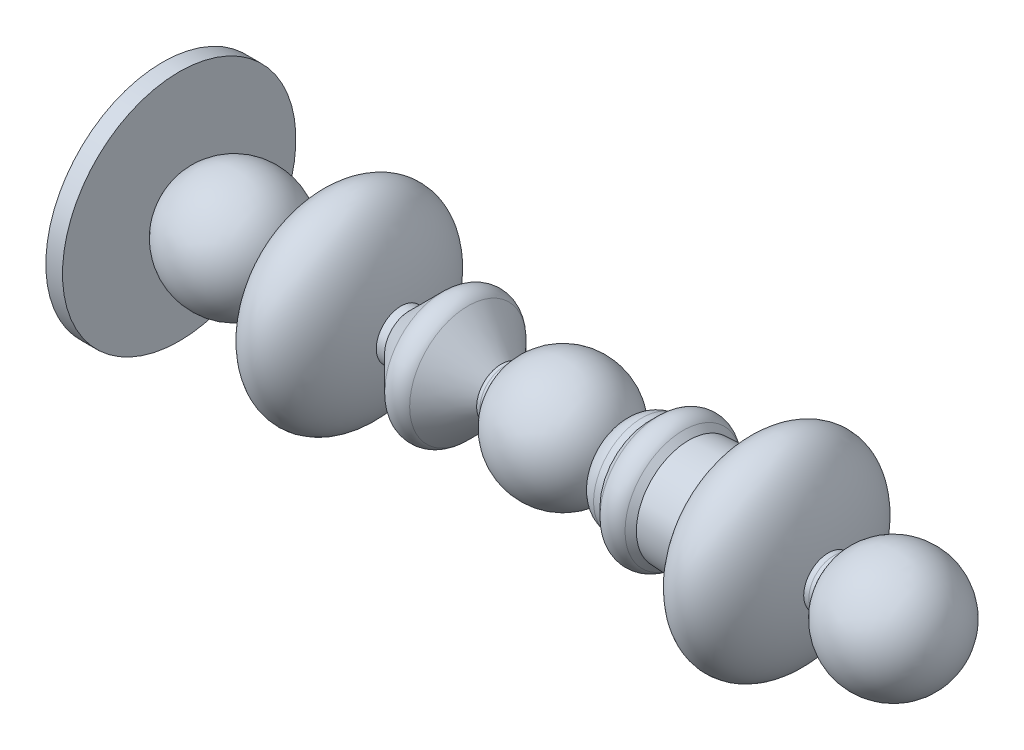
ISO-10303-21;
HEADER;
FILE_DESCRIPTION(('STEP AP214'),'2;1');
FILE_NAME('part.step','',(''),(''),'','','');
FILE_SCHEMA(('AUTOMOTIVE_DESIGN { 1 0 10303 214 1 1 1 1 }'));
ENDSEC;
DATA;
#1=APPLICATION_CONTEXT('core data for automotive mechanical design processes');
#2=APPLICATION_PROTOCOL_DEFINITION('international standard','automotive_design',2000,#1);
#3=PRODUCT_CONTEXT('',#1,'mechanical');
#4=PRODUCT('Part','Part','',(#3));
#5=PRODUCT_RELATED_PRODUCT_CATEGORY('part','',(#4));
#6=PRODUCT_DEFINITION_FORMATION('','',#4);
#7=PRODUCT_DEFINITION_CONTEXT('part definition',#1,'design');
#8=PRODUCT_DEFINITION('design','',#6,#7);
#9=PRODUCT_DEFINITION_SHAPE('','',#8);
#10=(LENGTH_UNIT() NAMED_UNIT(*) SI_UNIT(.MILLI.,.METRE.));
#11=(NAMED_UNIT(*) PLANE_ANGLE_UNIT() SI_UNIT($,.RADIAN.));
#12=(NAMED_UNIT(*) SI_UNIT($,.STERADIAN.) SOLID_ANGLE_UNIT());
#13=UNCERTAINTY_MEASURE_WITH_UNIT(LENGTH_MEASURE(1.E-05),#10,'distance_accuracy_value','');
#14=(GEOMETRIC_REPRESENTATION_CONTEXT(3) GLOBAL_UNCERTAINTY_ASSIGNED_CONTEXT((#13)) GLOBAL_UNIT_ASSIGNED_CONTEXT((#10,
#11,#12)) REPRESENTATION_CONTEXT('',''));
#15=CARTESIAN_POINT('',(0.,0.,0.));
#16=DIRECTION('',(0.,0.,1.));
#17=DIRECTION('',(1.,0.,0.));
#18=AXIS2_PLACEMENT_3D('',#15,#16,#17);
#19=CARTESIAN_POINT('',(-493.124200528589,0.,0.));
#20=DIRECTION('',(1.,0.,0.));
#21=DIRECTION('',(0.,1.,0.));
#22=AXIS2_PLACEMENT_3D('',#19,#20,#21);
#23=SPHERICAL_SURFACE('',#22,90.);
#24=CARTESIAN_POINT('',(-410.624200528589,0.,0.));
#25=DIRECTION('',(-1.,0.,0.));
#26=DIRECTION('',(0.,-1.,0.));
#27=AXIS2_PLACEMENT_3D('',#24,#25,#26);
#28=CIRCLE('',#27,35.9687364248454);
#29=CARTESIAN_POINT('',(-410.624200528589,35.9687364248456,0.));
#30=VERTEX_POINT('',#29);
#31=EDGE_CURVE('E51',#30,#30,#28,.T.);
#32=CARTESIAN_POINT('',(-575.624200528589,0.,0.));
#33=DIRECTION('',(-1.,0.,0.));
#34=DIRECTION('',(0.,-1.,0.));
#35=AXIS2_PLACEMENT_3D('',#32,#33,#34);
#36=CIRCLE('',#35,35.9687364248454);
#37=CARTESIAN_POINT('',(-575.624200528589,35.9687364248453,0.));
#38=VERTEX_POINT('',#37);
#39=EDGE_CURVE('E11',#38,#38,#36,.T.);
#40=CARTESIAN_POINT('',(-410.624200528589,35.9687364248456,0.));
#41=CARTESIAN_POINT('',(-411.058686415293,36.9653219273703,0.));
#42=CARTESIAN_POINT('',(-411.511246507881,37.9540267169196,0.));
#43=CARTESIAN_POINT('',(-412.451884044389,39.9143942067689,0.));
#44=CARTESIAN_POINT('',(-412.939961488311,40.8860569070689,0.));
#45=CARTESIAN_POINT('',(-413.951002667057,42.811059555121,0.));
#46=CARTESIAN_POINT('',(-414.47396640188,43.7643995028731,0.));
#47=CARTESIAN_POINT('',(-415.554090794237,45.6515060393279,0.));
#48=CARTESIAN_POINT('',(-416.11125145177,46.5852726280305,0.));
#49=CARTESIAN_POINT('',(-417.25903876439,48.4320059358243,0.));
#50=CARTESIAN_POINT('',(-417.849665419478,49.3449726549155,0.));
#51=CARTESIAN_POINT('',(-419.063608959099,51.148907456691,0.));
#52=CARTESIAN_POINT('',(-419.686925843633,52.0398755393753,0.));
#53=CARTESIAN_POINT('',(-420.965431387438,53.7986430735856,0.));
#54=CARTESIAN_POINT('',(-421.62062004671,54.6664425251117,0.));
#55=CARTESIAN_POINT('',(-422.9620087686,56.3777332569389,0.));
#56=CARTESIAN_POINT('',(-423.648208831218,57.2212245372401,0.));
#57=CARTESIAN_POINT('',(-425.050719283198,58.8827912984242,0.));
#58=CARTESIAN_POINT('',(-425.767029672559,59.7008667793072,0.));
#59=CARTESIAN_POINT('',(-427.228820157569,61.3105276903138,0.));
#60=CARTESIAN_POINT('',(-427.974300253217,62.1021131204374,0.));
#61=CARTESIAN_POINT('',(-429.493451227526,63.6577544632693,0.));
#62=CARTESIAN_POINT('',(-430.267122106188,64.4218103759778,0.));
#63=CARTESIAN_POINT('',(-431.841638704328,65.9213893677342,0.));
#64=CARTESIAN_POINT('',(-432.642484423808,66.6569124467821,0.));
#65=CARTESIAN_POINT('',(-434.27029907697,68.0984599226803,0.));
#66=CARTESIAN_POINT('',(-435.097268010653,68.8044843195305,0.));
#67=CARTESIAN_POINT('',(-436.776243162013,70.1861073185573,0.));
#68=CARTESIAN_POINT('',(-437.62824937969,70.8617059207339,0.));
#69=CARTESIAN_POINT('',(-439.356180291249,72.1815901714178,0.));
#70=CARTESIAN_POINT('',(-440.23210498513,72.8258758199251,0.));
#71=CARTESIAN_POINT('',(-442.006722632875,74.0822881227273,0.));
#72=CARTESIAN_POINT('',(-442.90541558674,74.6944147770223,0.));
#73=CARTESIAN_POINT('',(-444.724389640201,75.8857052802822,0.));
#74=CARTESIAN_POINT('',(-445.644670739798,76.4648691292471,0.));
#75=CARTESIAN_POINT('',(-447.505612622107,77.5894734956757,0.));
#76=CARTESIAN_POINT('',(-448.446273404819,78.1349140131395,0.));
#77=CARTESIAN_POINT('',(-450.34673942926,79.191355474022,0.));
#78=CARTESIAN_POINT('',(-451.306544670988,79.7023564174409,0.));
#79=CARTESIAN_POINT('',(-453.244039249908,80.6892477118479,0.));
#80=CARTESIAN_POINT('',(-454.221728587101,81.1651380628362,0.));
#81=CARTESIAN_POINT('',(-456.193707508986,82.0811832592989,0.));
#82=CARTESIAN_POINT('',(-457.187997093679,82.5213381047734,0.));
#83=CARTESIAN_POINT('',(-459.191870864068,83.3653343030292,0.));
#84=CARTESIAN_POINT('',(-460.201455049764,83.7691756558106,0.));
#85=CARTESIAN_POINT('',(-462.23459229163,84.5400145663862,0.));
#86=CARTESIAN_POINT('',(-463.258145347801,84.9070121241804,0.));
#87=CARTESIAN_POINT('',(-465.317876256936,85.6036815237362,0.));
#88=CARTESIAN_POINT('',(-466.3540541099,85.9333533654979,0.));
#89=CARTESIAN_POINT('',(-468.437673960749,86.5549384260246,0.));
#90=CARTESIAN_POINT('',(-469.485115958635,86.8468516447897,0.));
#91=CARTESIAN_POINT('',(-471.589888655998,87.3925361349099,0.));
#92=CARTESIAN_POINT('',(-472.647219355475,87.6463074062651,0.));
#93=CARTESIAN_POINT('',(-474.770381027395,88.1153747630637,0.));
#94=CARTESIAN_POINT('',(-475.836211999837,88.3306708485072,0.));
#95=CARTESIAN_POINT('',(-477.974974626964,88.7225051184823,0.));
#96=CARTESIAN_POINT('',(-479.047906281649,88.899043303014,0.));
#97=CARTESIAN_POINT('',(-481.199461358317,89.2131299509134,0.));
#98=CARTESIAN_POINT('',(-482.278084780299,89.3506784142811,0.));
#99=CARTESIAN_POINT('',(-484.439607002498,89.5866049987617,0.));
#100=CARTESIAN_POINT('',(-485.522505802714,89.6849831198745,0.));
#101=CARTESIAN_POINT('',(-487.691156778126,89.8424398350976,0.));
#102=CARTESIAN_POINT('',(-488.776908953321,89.9015184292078,0.));
#103=CARTESIAN_POINT('',(-490.949840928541,89.980298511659,0.));
#104=CARTESIAN_POINT('',(-492.037020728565,90.,0.));
#105=CARTESIAN_POINT('',(-494.211380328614,90.,0.));
#106=CARTESIAN_POINT('',(-495.298560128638,89.980298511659,0.));
#107=CARTESIAN_POINT('',(-497.471492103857,89.9015184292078,0.));
#108=CARTESIAN_POINT('',(-498.557244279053,89.8424398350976,0.));
#109=CARTESIAN_POINT('',(-500.725895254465,89.6849831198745,0.));
#110=CARTESIAN_POINT('',(-501.808794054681,89.5866049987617,0.));
#111=CARTESIAN_POINT('',(-503.970316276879,89.3506784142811,0.));
#112=CARTESIAN_POINT('',(-505.048939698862,89.2131299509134,0.));
#113=CARTESIAN_POINT('',(-507.200494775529,88.8990433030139,0.));
#114=CARTESIAN_POINT('',(-508.273426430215,88.7225051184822,0.));
#115=CARTESIAN_POINT('',(-510.412189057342,88.3306708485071,0.));
#116=CARTESIAN_POINT('',(-511.478020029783,88.1153747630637,0.));
#117=CARTESIAN_POINT('',(-513.601181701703,87.6463074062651,0.));
#118=CARTESIAN_POINT('',(-514.658512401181,87.3925361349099,0.));
#119=CARTESIAN_POINT('',(-516.763285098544,86.8468516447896,0.));
#120=CARTESIAN_POINT('',(-517.810727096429,86.5549384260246,0.));
#121=CARTESIAN_POINT('',(-519.894346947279,85.9333533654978,0.));
#122=CARTESIAN_POINT('',(-520.930524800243,85.6036815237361,0.));
#123=CARTESIAN_POINT('',(-522.990255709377,84.9070121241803,0.));
#124=CARTESIAN_POINT('',(-524.013808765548,84.5400145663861,0.));
#125=CARTESIAN_POINT('',(-526.046946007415,83.7691756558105,0.));
#126=CARTESIAN_POINT('',(-527.056530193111,83.3653343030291,0.));
#127=CARTESIAN_POINT('',(-529.0604039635,82.5213381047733,0.));
#128=CARTESIAN_POINT('',(-530.054693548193,82.0811832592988,0.));
#129=CARTESIAN_POINT('',(-532.026672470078,81.1651380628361,0.));
#130=CARTESIAN_POINT('',(-533.004361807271,80.6892477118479,0.));
#131=CARTESIAN_POINT('',(-534.941856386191,79.7023564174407,0.));
#132=CARTESIAN_POINT('',(-535.901661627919,79.1913554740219,0.));
#133=CARTESIAN_POINT('',(-537.802127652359,78.1349140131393,0.));
#134=CARTESIAN_POINT('',(-538.742788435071,77.5894734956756,0.));
#135=CARTESIAN_POINT('',(-540.60373031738,76.464869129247,0.));
#136=CARTESIAN_POINT('',(-541.524011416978,75.885705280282,0.));
#137=CARTESIAN_POINT('',(-543.342985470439,74.6944147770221,0.));
#138=CARTESIAN_POINT('',(-544.241678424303,74.0822881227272,0.));
#139=CARTESIAN_POINT('',(-546.016296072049,72.825875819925,0.));
#140=CARTESIAN_POINT('',(-546.89222076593,72.1815901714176,0.));
#141=CARTESIAN_POINT('',(-548.620151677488,70.8617059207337,0.));
#142=CARTESIAN_POINT('',(-549.472157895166,70.1861073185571,0.));
#143=CARTESIAN_POINT('',(-551.151133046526,68.8044843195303,0.));
#144=CARTESIAN_POINT('',(-551.978101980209,68.0984599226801,0.));
#145=CARTESIAN_POINT('',(-553.605916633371,66.656912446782,0.));
#146=CARTESIAN_POINT('',(-554.40676235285,65.921389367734,0.));
#147=CARTESIAN_POINT('',(-555.981278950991,64.4218103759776,0.));
#148=CARTESIAN_POINT('',(-556.754949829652,63.6577544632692,0.));
#149=CARTESIAN_POINT('',(-558.274100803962,62.1021131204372,0.));
#150=CARTESIAN_POINT('',(-559.01958089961,61.3105276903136,0.));
#151=CARTESIAN_POINT('',(-560.481371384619,59.700866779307,0.));
#152=CARTESIAN_POINT('',(-561.197681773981,58.882791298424,0.));
#153=CARTESIAN_POINT('',(-562.600192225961,57.2212245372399,0.));
#154=CARTESIAN_POINT('',(-563.286392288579,56.3777332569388,0.));
#155=CARTESIAN_POINT('',(-564.627781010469,54.6664425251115,0.));
#156=CARTESIAN_POINT('',(-565.282969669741,53.7986430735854,0.));
#157=CARTESIAN_POINT('',(-566.561475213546,52.039875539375,0.));
#158=CARTESIAN_POINT('',(-567.18479209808,51.1489074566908,0.));
#159=CARTESIAN_POINT('',(-568.398735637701,49.3449726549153,0.));
#160=CARTESIAN_POINT('',(-568.989362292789,48.4320059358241,0.));
#161=CARTESIAN_POINT('',(-570.137149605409,46.5852726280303,0.));
#162=CARTESIAN_POINT('',(-570.694310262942,45.6515060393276,0.));
#163=CARTESIAN_POINT('',(-571.774434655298,43.7643995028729,0.));
#164=CARTESIAN_POINT('',(-572.297398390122,42.8110595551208,0.));
#165=CARTESIAN_POINT('',(-573.308439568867,40.8860569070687,0.));
#166=CARTESIAN_POINT('',(-573.796517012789,39.9143942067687,0.));
#167=CARTESIAN_POINT('',(-574.737154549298,37.9540267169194,0.));
#168=CARTESIAN_POINT('',(-575.189714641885,36.96532192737,0.));
#169=CARTESIAN_POINT('',(-575.624200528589,35.9687364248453,0.));
#170=B_SPLINE_CURVE_WITH_KNOTS('',3,(#40,#41,#42,#43,#44,#45,#46,#47,#48,#49,#50,#51,#52,#53,
#54,#55,#56,#57,#58,#59,#60,#61,#62,#63,#64,#65,#66,#67,#68,#69,#70,#71,#72,#73,#74,#75,#76,#77,
#78,#79,#80,#81,#82,#83,#84,#85,#86,#87,#88,#89,#90,#91,#92,#93,#94,#95,#96,#97,#98,#99,#100,
#101,#102,#103,#104,#105,#106,#107,#108,#109,#110,#111,#112,#113,#114,#115,#116,#117,#118,#119,
#120,#121,#122,#123,#124,#125,#126,#127,#128,#129,#130,#131,#132,#133,#134,#135,#136,#137,#138,
#139,#140,#141,#142,#143,#144,#145,#146,#147,#148,#149,#150,#151,#152,#153,#154,#155,#156,#157,
#158,#159,#160,#161,#162,#163,#164,#165,#166,#167,#168,#169),.UNSPECIFIED.,.F.,.F.,(4,2,2,2,2,2,
2,2,2,2,2,2,2,2,2,2,2,2,2,2,2,2,2,2,2,2,2,2,2,2,2,2,2,2,2,2,2,2,2,2,2,2,2,2,2,2,2,2,2,2,2,2,2,2,
2,2,2,2,2,2,2,2,2,2,4),(0.,3.26136096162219,6.52272192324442,9.7840828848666,13.0454438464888,
16.306804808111,19.5681657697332,22.8295267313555,26.0908876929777,29.3522486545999,
32.6136096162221,35.8749705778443,39.1363315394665,42.3976925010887,45.659053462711,
48.9204144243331,52.1817753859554,55.4431363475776,58.7044973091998,61.965858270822,
65.2272192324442,68.4885801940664,71.7499411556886,75.0113021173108,78.272663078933,
81.5340240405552,84.7953850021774,88.0567459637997,91.3181069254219,94.5794678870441,
97.8408288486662,101.102189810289,104.363550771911,107.624911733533,110.886272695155,
114.147633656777,117.4089946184,120.670355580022,123.931716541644,127.193077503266,
130.454438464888,133.715799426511,136.977160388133,140.238521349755,143.499882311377,
146.761243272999,150.022604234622,153.283965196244,156.545326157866,159.806687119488,
163.06804808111,166.329409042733,169.590770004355,172.852130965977,176.113491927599,
179.374852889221,182.636213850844,185.897574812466,189.158935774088,192.42029673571,
195.681657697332,198.943018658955,202.204379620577,205.465740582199,208.727101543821),.UNSPECIFIED.);
#171=EDGE_CURVE('BSEAM45',#30,#38,#170,.T.);
#172=ORIENTED_EDGE('',*,*,#31,.T.);
#173=ORIENTED_EDGE('',*,*,#39,.F.);
#174=ORIENTED_EDGE('',*,*,#171,.T.);
#175=ORIENTED_EDGE('',*,*,#171,.F.);
#176=EDGE_LOOP('',(#172,#174,#173,#175));
#177=FACE_BOUND('',#176,.T.);
#178=ADVANCED_FACE('F45',(#177),#23,.T.);
#179=CARTESIAN_POINT('',(-410.624200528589,35.9687364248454,0.));
#180=DIRECTION('',(-1.,0.,0.));
#181=DIRECTION('',(0.,1.,0.));
#182=AXIS2_PLACEMENT_3D('',#179,#180,#181);
#183=PLANE('',#182);
#184=ORIENTED_EDGE('',*,*,#31,.F.);
#185=EDGE_LOOP('',(#184));
#186=FACE_BOUND('',#185,.T.);
#187=ADVANCED_FACE('F78',(#186),#183,.F.);
#188=CARTESIAN_POINT('',(-600.624200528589,0.,0.));
#189=DIRECTION('',(1.,0.,0.));
#190=DIRECTION('',(0.,1.,0.));
#191=AXIS2_PLACEMENT_3D('',#188,#189,#190);
#192=CYLINDRICAL_SURFACE('',#191,175.);
#193=CARTESIAN_POINT('',(-600.624200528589,0.,0.));
#194=DIRECTION('',(-1.,0.,0.));
#195=DIRECTION('',(0.,-1.,0.));
#196=AXIS2_PLACEMENT_3D('',#193,#194,#195);
#197=CIRCLE('',#196,175.);
#198=CARTESIAN_POINT('',(-600.624200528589,-175.,0.));
#199=VERTEX_POINT('',#198);
#200=EDGE_CURVE('E55',#199,#199,#197,.T.);
#201=ORIENTED_EDGE('',*,*,#200,.F.);
#202=EDGE_LOOP('',(#201));
#203=FACE_BOUND('',#202,.T.);
#204=CARTESIAN_POINT('',(-575.624200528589,0.,0.));
#205=DIRECTION('',(-1.,0.,0.));
#206=DIRECTION('',(0.,-1.,0.));
#207=AXIS2_PLACEMENT_3D('',#204,#205,#206);
#208=CIRCLE('',#207,175.);
#209=CARTESIAN_POINT('',(-575.624200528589,-175.,0.));
#210=VERTEX_POINT('',#209);
#211=EDGE_CURVE('E59',#210,#210,#208,.T.);
#212=ORIENTED_EDGE('',*,*,#211,.T.);
#213=EDGE_LOOP('',(#212));
#214=FACE_BOUND('',#213,.T.);
#215=ADVANCED_FACE('F65',(#203,#214),#192,.T.);
#216=CARTESIAN_POINT('',(-600.624200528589,0.,0.));
#217=DIRECTION('',(-1.,0.,0.));
#218=DIRECTION('',(0.,-1.,0.));
#219=AXIS2_PLACEMENT_3D('',#216,#217,#218);
#220=PLANE('',#219);
#221=ORIENTED_EDGE('',*,*,#200,.T.);
#222=EDGE_LOOP('',(#221));
#223=FACE_BOUND('',#222,.T.);
#224=ADVANCED_FACE('F69',(#223),#220,.T.);
#225=CARTESIAN_POINT('',(-575.624200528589,0.,0.));
#226=DIRECTION('',(-1.,0.,0.));
#227=DIRECTION('',(0.,-1.,0.));
#228=AXIS2_PLACEMENT_3D('',#225,#226,#227);
#229=PLANE('',#228);
#230=ORIENTED_EDGE('',*,*,#39,.T.);
#231=EDGE_LOOP('',(#230));
#232=FACE_BOUND('',#231,.T.);
#233=ORIENTED_EDGE('',*,*,#211,.F.);
#234=EDGE_LOOP('',(#233));
#235=FACE_BOUND('',#234,.T.);
#236=ADVANCED_FACE('F67',(#232,#235),#229,.F.);
#237=CLOSED_SHELL('',(#178,#187,#215,#224,#236));
#238=MANIFOLD_SOLID_BREP('B2',#237);
#239=CARTESIAN_POINT('',(0.,0.,0.));
#240=DIRECTION('',(1.,0.,0.));
#241=DIRECTION('',(0.,0.,1.));
#242=AXIS2_PLACEMENT_3D('',#239,#240,#241);
#243=CYLINDRICAL_SURFACE('',#242,37.);
#244=CARTESIAN_POINT('',(-398.028030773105,0.,0.));
#245=DIRECTION('',(1.,0.,0.));
#246=DIRECTION('',(0.,0.,-1.));
#247=AXIS2_PLACEMENT_3D('',#244,#245,#246);
#248=CIRCLE('',#247,37.);
#249=CARTESIAN_POINT('',(-398.028030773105,0.,-37.));
#250=VERTEX_POINT('',#249);
#251=EDGE_CURVE('E147',#250,#250,#248,.T.);
#252=ORIENTED_EDGE('',*,*,#251,.F.);
#253=EDGE_LOOP('',(#252));
#254=FACE_BOUND('',#253,.T.);
#255=CARTESIAN_POINT('',(-404.326115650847,0.,0.));
#256=DIRECTION('',(-1.,0.,0.));
#257=DIRECTION('',(0.,0.,1.));
#258=AXIS2_PLACEMENT_3D('',#255,#256,#257);
#259=CIRCLE('',#258,37.);
#260=CARTESIAN_POINT('',(-404.326115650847,0.,37.));
#261=VERTEX_POINT('',#260);
#262=CARTESIAN_POINT('',(-404.326115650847,0.,-37.));
#263=VERTEX_POINT('',#262);
#264=EDGE_CURVE('E43',#261,#263,#259,.T.);
#265=ORIENTED_EDGE('',*,*,#264,.F.);
#266=EDGE_CURVE('E129',#263,#261,#259,.T.);
#267=ORIENTED_EDGE('',*,*,#266,.F.);
#268=EDGE_LOOP('',(#265,#267));
#269=FACE_BOUND('',#268,.T.);
#270=ADVANCED_FACE('F125',(#254,#269),#243,.T.);
#271=ORIENTED_EDGE('',*,*,#266,.T.);
#272=ORIENTED_EDGE('',*,*,#264,.T.);
#273=EDGE_LOOP('',(#271,#272));
#274=FACE_BOUND('',#273,.T.);
#275=CARTESIAN_POINT('',(-410.624200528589,0.,0.));
#276=DIRECTION('',(-1.,0.,0.));
#277=DIRECTION('',(0.,0.,1.));
#278=AXIS2_PLACEMENT_3D('',#275,#276,#277);
#279=CIRCLE('',#278,37.);
#280=CARTESIAN_POINT('',(-410.624200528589,0.,37.));
#281=VERTEX_POINT('',#280);
#282=EDGE_CURVE('E143',#281,#281,#279,.T.);
#283=ORIENTED_EDGE('',*,*,#282,.F.);
#284=EDGE_LOOP('',(#283));
#285=FACE_BOUND('',#284,.T.);
#286=ADVANCED_FACE('F127',(#274,#285),#243,.T.);
#287=CARTESIAN_POINT('',(-410.624200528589,0.,0.));
#288=DIRECTION('',(1.,0.,0.));
#289=DIRECTION('',(0.,0.,1.));
#290=AXIS2_PLACEMENT_3D('',#287,#288,#289);
#291=PLANE('',#290);
#292=ORIENTED_EDGE('',*,*,#282,.T.);
#293=EDGE_LOOP('',(#292));
#294=FACE_BOUND('',#293,.T.);
#295=ADVANCED_FACE('F164',(#294),#291,.F.);
#296=CARTESIAN_POINT('',(-320.5,0.,0.));
#297=DIRECTION('',(0.,0.,-1.));
#298=DIRECTION('',(0.,1.,0.));
#299=AXIS2_PLACEMENT_3D('',#296,#297,#298);
#300=ELLIPSE('',#299,150.,80.);
#301=TRIMMED_CURVE('',#300,(PARAMETER_VALUE(4.71238898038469)),
(PARAMETER_VALUE(7.85398163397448)),.T.,.PARAMETER.);
#302=CARTESIAN_POINT('',(0.,0.,0.));
#303=DIRECTION('',(1.,0.,0.));
#304=AXIS1_PLACEMENT('',#302,#303);
#305=SURFACE_OF_REVOLUTION('',#301,#304);
#306=CARTESIAN_POINT('',(-242.971969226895,0.,0.));
#307=DIRECTION('',(1.,0.,0.));
#308=DIRECTION('',(0.,0.,-1.));
#309=AXIS2_PLACEMENT_3D('',#306,#307,#308);
#310=CIRCLE('',#309,37.);
#311=CARTESIAN_POINT('',(-242.971969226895,0.,-37.));
#312=VERTEX_POINT('',#311);
#313=EDGE_CURVE('E151',#312,#312,#310,.T.);
#314=ORIENTED_EDGE('',*,*,#313,.F.);
#315=EDGE_LOOP('',(#314));
#316=FACE_BOUND('',#315,.T.);
#317=ORIENTED_EDGE('',*,*,#251,.T.);
#318=EDGE_LOOP('',(#317));
#319=FACE_BOUND('',#318,.T.);
#320=ADVANCED_FACE('F160',(#316,#319),#305,.T.);
#321=CARTESIAN_POINT('',(-400.502,0.,0.));
#322=DIRECTION('',(1.,0.,0.));
#323=DIRECTION('',(0.,0.,-1.));
#324=AXIS2_PLACEMENT_3D('',#321,#322,#323);
#325=CYLINDRICAL_SURFACE('',#324,37.);
#326=ORIENTED_EDGE('',*,*,#313,.T.);
#327=EDGE_LOOP('',(#326));
#328=FACE_BOUND('',#327,.T.);
#329=CARTESIAN_POINT('',(-230.5,0.,0.));
#330=DIRECTION('',(-1.,0.,0.));
#331=DIRECTION('',(0.,0.,1.));
#332=AXIS2_PLACEMENT_3D('',#329,#330,#331);
#333=CIRCLE('',#332,37.);
#334=CARTESIAN_POINT('',(-230.5,0.,37.));
#335=VERTEX_POINT('',#334);
#336=EDGE_CURVE('E156',#335,#335,#333,.T.);
#337=ORIENTED_EDGE('',*,*,#336,.T.);
#338=EDGE_LOOP('',(#337));
#339=FACE_BOUND('',#338,.T.);
#340=ADVANCED_FACE('F163',(#328,#339),#325,.T.);
#341=CARTESIAN_POINT('',(-230.5,37.,0.));
#342=DIRECTION('',(-1.,0.,0.));
#343=DIRECTION('',(0.,0.,-1.));
#344=AXIS2_PLACEMENT_3D('',#341,#342,#343);
#345=PLANE('',#344);
#346=ORIENTED_EDGE('',*,*,#336,.F.);
#347=EDGE_LOOP('',(#346));
#348=FACE_BOUND('',#347,.T.);
#349=ADVANCED_FACE('F195',(#348),#345,.F.);
#350=CLOSED_SHELL('',(#270,#286,#295,#320,#340,#349));
#351=MANIFOLD_SOLID_BREP('B6',#350);
#352=CARTESIAN_POINT('',(0.,0.,0.));
#353=DIRECTION('',(1.,0.,0.));
#354=DIRECTION('',(0.,0.,1.));
#355=AXIS2_PLACEMENT_3D('',#352,#353,#354);
#356=CYLINDRICAL_SURFACE('',#355,37.);
#357=CARTESIAN_POINT('',(-82.5,0.,0.));
#358=DIRECTION('',(-1.,0.,0.));
#359=DIRECTION('',(0.,0.,1.));
#360=AXIS2_PLACEMENT_3D('',#357,#358,#359);
#361=CIRCLE('',#360,37.);
#362=CARTESIAN_POINT('',(-82.5,0.,37.));
#363=VERTEX_POINT('',#362);
#364=EDGE_CURVE('E258',#363,#363,#361,.T.);
#365=ORIENTED_EDGE('',*,*,#364,.T.);
#366=EDGE_LOOP('',(#365));
#367=FACE_BOUND('',#366,.T.);
#368=CARTESIAN_POINT('',(-87.5,0.,0.));
#369=DIRECTION('',(-1.,0.,0.));
#370=DIRECTION('',(0.,0.,1.));
#371=AXIS2_PLACEMENT_3D('',#368,#369,#370);
#372=CIRCLE('',#371,37.);
#373=CARTESIAN_POINT('',(-87.5,0.,37.));
#374=VERTEX_POINT('',#373);
#375=CARTESIAN_POINT('',(-87.5,0.,-37.));
#376=VERTEX_POINT('',#375);
#377=EDGE_CURVE('E123',#374,#376,#372,.T.);
#378=ORIENTED_EDGE('',*,*,#377,.F.);
#379=EDGE_CURVE('E243',#376,#374,#372,.T.);
#380=ORIENTED_EDGE('',*,*,#379,.F.);
#381=EDGE_LOOP('',(#378,#380));
#382=FACE_BOUND('',#381,.T.);
#383=ADVANCED_FACE('F239',(#367,#382),#356,.T.);
#384=CARTESIAN_POINT('',(-82.5,0.,0.));
#385=DIRECTION('',(-1.,0.,0.));
#386=DIRECTION('',(0.,0.,-1.));
#387=AXIS2_PLACEMENT_3D('',#384,#385,#386);
#388=PLANE('',#387);
#389=ORIENTED_EDGE('',*,*,#364,.F.);
#390=EDGE_LOOP('',(#389));
#391=FACE_BOUND('',#390,.T.);
#392=ADVANCED_FACE('F241',(#391),#388,.F.);
#393=ORIENTED_EDGE('',*,*,#379,.T.);
#394=ORIENTED_EDGE('',*,*,#377,.T.);
#395=EDGE_LOOP('',(#393,#394));
#396=FACE_BOUND('',#395,.T.);
#397=CARTESIAN_POINT('',(-92.5,0.,0.));
#398=DIRECTION('',(-1.,0.,0.));
#399=DIRECTION('',(0.,0.,1.));
#400=AXIS2_PLACEMENT_3D('',#397,#398,#399);
#401=CIRCLE('',#400,37.);
#402=CARTESIAN_POINT('',(-92.5,0.,37.));
#403=VERTEX_POINT('',#402);
#404=EDGE_CURVE('E262',#403,#403,#401,.T.);
#405=ORIENTED_EDGE('',*,*,#404,.F.);
#406=EDGE_LOOP('',(#405));
#407=FACE_BOUND('',#406,.T.);
#408=ADVANCED_FACE('F255',(#396,#407),#356,.T.);
#409=CARTESIAN_POINT('',(-92.5,0.,0.));
#410=DIRECTION('',(1.,0.,0.));
#411=DIRECTION('',(0.,0.,1.));
#412=AXIS2_PLACEMENT_3D('',#409,#410,#411);
#413=PLANE('',#412);
#414=ORIENTED_EDGE('',*,*,#404,.T.);
#415=EDGE_LOOP('',(#414));
#416=FACE_BOUND('',#415,.T.);
#417=ADVANCED_FACE('F269',(#416),#413,.F.);
#418=CLOSED_SHELL('',(#383,#392,#408,#417));
#419=MANIFOLD_SOLID_BREP('B37',#418);
#420=CARTESIAN_POINT('',(-161.5,0.,0.));
#421=DIRECTION('',(1.,0.,0.));
#422=DIRECTION('',(0.,0.,1.));
#423=AXIS2_PLACEMENT_3D('',#420,#421,#422);
#424=TOROIDAL_SURFACE('',#423,68.4436508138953,26.5563491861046);
#425=CARTESIAN_POINT('',(-142.721825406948,0.,0.));
#426=DIRECTION('',(-1.,0.,0.));
#427=DIRECTION('',(0.,0.,1.));
#428=AXIS2_PLACEMENT_3D('',#425,#426,#427);
#429=CIRCLE('',#428,87.2218254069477);
#430=CARTESIAN_POINT('',(-142.721825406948,0.,87.2218254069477));
#431=VERTEX_POINT('',#430);
#432=EDGE_CURVE('E238',#431,#431,#429,.T.);
#433=ORIENTED_EDGE('',*,*,#432,.T.);
#434=EDGE_LOOP('',(#433));
#435=FACE_BOUND('',#434,.T.);
#436=CARTESIAN_POINT('',(-180.278174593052,0.,0.));
#437=DIRECTION('',(-1.,0.,0.));
#438=DIRECTION('',(0.,0.,1.));
#439=AXIS2_PLACEMENT_3D('',#436,#437,#438);
#440=CIRCLE('',#439,87.2218254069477);
#441=CARTESIAN_POINT('',(-180.278174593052,0.,87.2218254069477));
#442=VERTEX_POINT('',#441);
#443=EDGE_CURVE('E334',#442,#442,#440,.T.);
#444=ORIENTED_EDGE('',*,*,#443,.F.);
#445=EDGE_LOOP('',(#444));
#446=FACE_BOUND('',#445,.T.);
#447=ADVANCED_FACE('F320',(#435,#446),#424,.T.);
#448=CARTESIAN_POINT('',(-142.721825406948,0.,0.));
#449=DIRECTION('',(-1.,0.,0.));
#450=DIRECTION('',(0.,0.,-1.));
#451=AXIS2_PLACEMENT_3D('',#448,#449,#450);
#452=CONICAL_SURFACE('',#451,87.2218254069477,0.78539816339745);
#453=CARTESIAN_POINT('',(-92.5,0.,0.));
#454=DIRECTION('',(-1.,0.,0.));
#455=DIRECTION('',(0.,0.,1.));
#456=AXIS2_PLACEMENT_3D('',#453,#454,#455);
#457=CIRCLE('',#456,37.);
#458=CARTESIAN_POINT('',(-92.5,0.,37.));
#459=VERTEX_POINT('',#458);
#460=EDGE_CURVE('E326',#459,#459,#457,.T.);
#461=ORIENTED_EDGE('',*,*,#460,.T.);
#462=EDGE_LOOP('',(#461));
#463=FACE_BOUND('',#462,.T.);
#464=ORIENTED_EDGE('',*,*,#432,.F.);
#465=EDGE_LOOP('',(#464));
#466=FACE_BOUND('',#465,.T.);
#467=ADVANCED_FACE('F344',(#463,#466),#452,.T.);
#468=CARTESIAN_POINT('',(-92.5,0.,0.));
#469=DIRECTION('',(-1.,0.,0.));
#470=DIRECTION('',(0.,0.,-1.));
#471=AXIS2_PLACEMENT_3D('',#468,#469,#470);
#472=PLANE('',#471);
#473=ORIENTED_EDGE('',*,*,#460,.F.);
#474=EDGE_LOOP('',(#473));
#475=FACE_BOUND('',#474,.T.);
#476=ADVANCED_FACE('F348',(#475),#472,.F.);
#477=CARTESIAN_POINT('',(-230.5,0.,0.));
#478=DIRECTION('',(1.,0.,0.));
#479=DIRECTION('',(0.,0.,1.));
#480=AXIS2_PLACEMENT_3D('',#477,#478,#479);
#481=PLANE('',#480);
#482=CARTESIAN_POINT('',(-230.5,0.,0.));
#483=DIRECTION('',(-1.,0.,0.));
#484=DIRECTION('',(0.,0.,1.));
#485=AXIS2_PLACEMENT_3D('',#482,#483,#484);
#486=CIRCLE('',#485,37.);
#487=CARTESIAN_POINT('',(-230.5,0.,37.));
#488=VERTEX_POINT('',#487);
#489=EDGE_CURVE('E330',#488,#488,#486,.T.);
#490=ORIENTED_EDGE('',*,*,#489,.T.);
#491=EDGE_LOOP('',(#490));
#492=FACE_BOUND('',#491,.T.);
#493=ADVANCED_FACE('F352',(#492),#481,.F.);
#494=CARTESIAN_POINT('',(-230.5,0.,0.));
#495=DIRECTION('',(1.,0.,0.));
#496=DIRECTION('',(0.,0.,1.));
#497=AXIS2_PLACEMENT_3D('',#494,#495,#496);
#498=CONICAL_SURFACE('',#497,37.,0.78539816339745);
#499=ORIENTED_EDGE('',*,*,#443,.T.);
#500=EDGE_LOOP('',(#499));
#501=FACE_BOUND('',#500,.T.);
#502=ORIENTED_EDGE('',*,*,#489,.F.);
#503=EDGE_LOOP('',(#502));
#504=FACE_BOUND('',#503,.T.);
#505=ADVANCED_FACE('F340',(#501,#504),#498,.T.);
#506=CLOSED_SHELL('',(#447,#467,#476,#493,#505));
#507=MANIFOLD_SOLID_BREP('B117',#506);
#508=CARTESIAN_POINT('',(585.479014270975,0.,0.));
#509=DIRECTION('',(-1.,0.,0.));
#510=DIRECTION('',(0.,0.,1.));
#511=AXIS2_PLACEMENT_3D('',#508,#509,#510);
#512=CYLINDRICAL_SURFACE('',#511,37.);
#513=CARTESIAN_POINT('',(413.4343424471,0.,0.));
#514=DIRECTION('',(1.,0.,0.));
#515=DIRECTION('',(0.,0.,-1.));
#516=AXIS2_PLACEMENT_3D('',#513,#514,#515);
#517=CIRCLE('',#516,37.);
#518=CARTESIAN_POINT('',(413.4343424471,0.,-37.));
#519=VERTEX_POINT('',#518);
#520=EDGE_CURVE('E419',#519,#519,#517,.F.);
#521=ORIENTED_EDGE('',*,*,#520,.T.);
#522=EDGE_LOOP('',(#521));
#523=FACE_BOUND('',#522,.T.);
#524=CARTESIAN_POINT('',(405.731186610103,0.,0.));
#525=DIRECTION('',(-1.,0.,0.));
#526=DIRECTION('',(0.,0.,1.));
#527=AXIS2_PLACEMENT_3D('',#524,#525,#526);
#528=CIRCLE('',#527,37.);
#529=CARTESIAN_POINT('',(405.731186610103,0.,37.));
#530=VERTEX_POINT('',#529);
#531=CARTESIAN_POINT('',(405.731186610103,0.,-37.));
#532=VERTEX_POINT('',#531);
#533=EDGE_CURVE('E318',#530,#532,#528,.T.);
#534=ORIENTED_EDGE('',*,*,#533,.F.);
#535=EDGE_CURVE('E404',#532,#530,#528,.T.);
#536=ORIENTED_EDGE('',*,*,#535,.F.);
#537=EDGE_LOOP('',(#534,#536));
#538=FACE_BOUND('',#537,.T.);
#539=ADVANCED_FACE('F400',(#523,#538),#512,.T.);
#540=CARTESIAN_POINT('',(495.477014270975,0.,0.));
#541=DIRECTION('',(-1.,0.,0.));
#542=DIRECTION('',(0.,1.,0.));
#543=AXIS2_PLACEMENT_3D('',#540,#541,#542);
#544=SPHERICAL_SURFACE('',#543,90.);
#545=ORIENTED_EDGE('',*,*,#520,.F.);
#546=EDGE_LOOP('',(#545));
#547=FACE_BOUND('',#546,.T.);
#548=ADVANCED_FACE('F402',(#547),#544,.T.);
#549=ORIENTED_EDGE('',*,*,#535,.T.);
#550=ORIENTED_EDGE('',*,*,#533,.T.);
#551=EDGE_LOOP('',(#549,#550));
#552=FACE_BOUND('',#551,.T.);
#553=CARTESIAN_POINT('',(398.028030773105,0.,0.));
#554=DIRECTION('',(-1.,0.,0.));
#555=DIRECTION('',(0.,0.,1.));
#556=AXIS2_PLACEMENT_3D('',#553,#554,#555);
#557=CIRCLE('',#556,37.);
#558=CARTESIAN_POINT('',(398.028030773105,0.,37.));
#559=VERTEX_POINT('',#558);
#560=EDGE_CURVE('E423',#559,#559,#557,.T.);
#561=ORIENTED_EDGE('',*,*,#560,.F.);
#562=EDGE_LOOP('',(#561));
#563=FACE_BOUND('',#562,.T.);
#564=ADVANCED_FACE('F416',(#552,#563),#512,.T.);
#565=CARTESIAN_POINT('',(320.5,0.,0.));
#566=DIRECTION('',(0.,0.,1.));
#567=DIRECTION('',(0.,1.,0.));
#568=AXIS2_PLACEMENT_3D('',#565,#566,#567);
#569=ELLIPSE('',#568,150.,80.);
#570=TRIMMED_CURVE('',#569,(PARAMETER_VALUE(4.71238898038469)),
(PARAMETER_VALUE(7.85398163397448)),.T.,.PARAMETER.);
#571=CARTESIAN_POINT('',(0.,0.,0.));
#572=DIRECTION('',(-1.,0.,0.));
#573=AXIS1_PLACEMENT('',#571,#572);
#574=SURFACE_OF_REVOLUTION('',#570,#573);
#575=CARTESIAN_POINT('',(242.971969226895,0.,0.));
#576=DIRECTION('',(-1.,0.,0.));
#577=DIRECTION('',(0.,0.,1.));
#578=AXIS2_PLACEMENT_3D('',#575,#576,#577);
#579=CIRCLE('',#578,37.);
#580=CARTESIAN_POINT('',(242.971969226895,0.,37.));
#581=VERTEX_POINT('',#580);
#582=EDGE_CURVE('E427',#581,#581,#579,.T.);
#583=ORIENTED_EDGE('',*,*,#582,.F.);
#584=EDGE_LOOP('',(#583));
#585=FACE_BOUND('',#584,.T.);
#586=ORIENTED_EDGE('',*,*,#560,.T.);
#587=EDGE_LOOP('',(#586));
#588=FACE_BOUND('',#587,.T.);
#589=ADVANCED_FACE('F436',(#585,#588),#574,.T.);
#590=CARTESIAN_POINT('',(400.502,0.,0.));
#591=DIRECTION('',(-1.,0.,0.));
#592=DIRECTION('',(0.,0.,1.));
#593=AXIS2_PLACEMENT_3D('',#590,#591,#592);
#594=CYLINDRICAL_SURFACE('',#593,37.);
#595=ORIENTED_EDGE('',*,*,#582,.T.);
#596=EDGE_LOOP('',(#595));
#597=FACE_BOUND('',#596,.T.);
#598=CARTESIAN_POINT('',(230.5,0.,0.));
#599=DIRECTION('',(-1.,0.,0.));
#600=DIRECTION('',(0.,0.,1.));
#601=AXIS2_PLACEMENT_3D('',#598,#599,#600);
#602=CIRCLE('',#601,37.);
#603=CARTESIAN_POINT('',(230.5,0.,37.));
#604=VERTEX_POINT('',#603);
#605=EDGE_CURVE('E432',#604,#604,#602,.T.);
#606=ORIENTED_EDGE('',*,*,#605,.F.);
#607=EDGE_LOOP('',(#606));
#608=FACE_BOUND('',#607,.T.);
#609=ADVANCED_FACE('F439',(#597,#608),#594,.T.);
#610=CARTESIAN_POINT('',(230.5,37.,0.));
#611=DIRECTION('',(1.,0.,0.));
#612=DIRECTION('',(0.,0.,-1.));
#613=AXIS2_PLACEMENT_3D('',#610,#611,#612);
#614=PLANE('',#613);
#615=ORIENTED_EDGE('',*,*,#605,.T.);
#616=EDGE_LOOP('',(#615));
#617=FACE_BOUND('',#616,.T.);
#618=ADVANCED_FACE('F469',(#617),#614,.F.);
#619=CLOSED_SHELL('',(#539,#548,#564,#589,#609,#618));
#620=MANIFOLD_SOLID_BREP('B233',#619);
#621=CARTESIAN_POINT('',(0.,0.,0.));
#622=DIRECTION('',(-1.,0.,0.));
#623=DIRECTION('',(0.,0.,1.));
#624=AXIS2_PLACEMENT_3D('',#621,#622,#623);
#625=CYLINDRICAL_SURFACE('',#624,37.);
#626=CARTESIAN_POINT('',(92.5,0.,0.));
#627=DIRECTION('',(-1.,0.,0.));
#628=DIRECTION('',(0.,0.,1.));
#629=AXIS2_PLACEMENT_3D('',#626,#627,#628);
#630=CIRCLE('',#629,37.);
#631=CARTESIAN_POINT('',(92.5,0.,37.));
#632=VERTEX_POINT('',#631);
#633=EDGE_CURVE('E537',#632,#632,#630,.T.);
#634=ORIENTED_EDGE('',*,*,#633,.T.);
#635=EDGE_LOOP('',(#634));
#636=FACE_BOUND('',#635,.T.);
#637=CARTESIAN_POINT('',(87.5,0.,0.));
#638=DIRECTION('',(-1.,0.,0.));
#639=DIRECTION('',(0.,0.,1.));
#640=AXIS2_PLACEMENT_3D('',#637,#638,#639);
#641=CIRCLE('',#640,37.);
#642=CARTESIAN_POINT('',(87.5,0.,37.));
#643=VERTEX_POINT('',#642);
#644=CARTESIAN_POINT('',(87.5,0.,-37.));
#645=VERTEX_POINT('',#644);
#646=EDGE_CURVE('E398',#643,#645,#641,.T.);
#647=ORIENTED_EDGE('',*,*,#646,.F.);
#648=EDGE_CURVE('E518',#645,#643,#641,.T.);
#649=ORIENTED_EDGE('',*,*,#648,.F.);
#650=EDGE_LOOP('',(#647,#649));
#651=FACE_BOUND('',#650,.T.);
#652=ADVANCED_FACE('F514',(#636,#651),#625,.T.);
#653=CARTESIAN_POINT('',(82.5,0.,0.));
#654=DIRECTION('',(1.,0.,0.));
#655=DIRECTION('',(0.,0.,-1.));
#656=AXIS2_PLACEMENT_3D('',#653,#654,#655);
#657=PLANE('',#656);
#658=CARTESIAN_POINT('',(82.5,0.,0.));
#659=DIRECTION('',(-1.,0.,0.));
#660=DIRECTION('',(0.,0.,1.));
#661=AXIS2_PLACEMENT_3D('',#658,#659,#660);
#662=CIRCLE('',#661,37.);
#663=CARTESIAN_POINT('',(82.5,0.,37.));
#664=VERTEX_POINT('',#663);
#665=EDGE_CURVE('E533',#664,#664,#662,.T.);
#666=ORIENTED_EDGE('',*,*,#665,.T.);
#667=EDGE_LOOP('',(#666));
#668=FACE_BOUND('',#667,.T.);
#669=ADVANCED_FACE('F516',(#668),#657,.F.);
#670=ORIENTED_EDGE('',*,*,#648,.T.);
#671=ORIENTED_EDGE('',*,*,#646,.T.);
#672=EDGE_LOOP('',(#670,#671));
#673=FACE_BOUND('',#672,.T.);
#674=ORIENTED_EDGE('',*,*,#665,.F.);
#675=EDGE_LOOP('',(#674));
#676=FACE_BOUND('',#675,.T.);
#677=ADVANCED_FACE('F530',(#673,#676),#625,.T.);
#678=CARTESIAN_POINT('',(92.5,0.,0.));
#679=DIRECTION('',(-1.,0.,0.));
#680=DIRECTION('',(0.,0.,1.));
#681=AXIS2_PLACEMENT_3D('',#678,#679,#680);
#682=PLANE('',#681);
#683=ORIENTED_EDGE('',*,*,#633,.F.);
#684=EDGE_LOOP('',(#683));
#685=FACE_BOUND('',#684,.T.);
#686=ADVANCED_FACE('F545',(#685),#682,.F.);
#687=CLOSED_SHELL('',(#652,#669,#677,#686));
#688=MANIFOLD_SOLID_BREP('B312',#687);
#689=CARTESIAN_POINT('',(161.5,0.,0.));
#690=DIRECTION('',(-1.,0.,0.));
#691=DIRECTION('',(0.,0.,1.));
#692=AXIS2_PLACEMENT_3D('',#689,#690,#691);
#693=TOROIDAL_SURFACE('',#692,68.4436508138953,26.5563491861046);
#694=CARTESIAN_POINT('',(142.721825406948,0.,0.));
#695=DIRECTION('',(-1.,0.,0.));
#696=DIRECTION('',(0.,0.,1.));
#697=AXIS2_PLACEMENT_3D('',#694,#695,#696);
#698=CIRCLE('',#697,87.2218254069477);
#699=CARTESIAN_POINT('',(142.721825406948,0.,87.2218254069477));
#700=VERTEX_POINT('',#699);
#701=EDGE_CURVE('E513',#700,#700,#698,.T.);
#702=ORIENTED_EDGE('',*,*,#701,.F.);
#703=EDGE_LOOP('',(#702));
#704=FACE_BOUND('',#703,.T.);
#705=CARTESIAN_POINT('',(180.278174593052,0.,0.));
#706=DIRECTION('',(-1.,0.,0.));
#707=DIRECTION('',(0.,0.,1.));
#708=AXIS2_PLACEMENT_3D('',#705,#706,#707);
#709=CIRCLE('',#708,87.2218254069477);
#710=CARTESIAN_POINT('',(180.278174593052,0.,87.2218254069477));
#711=VERTEX_POINT('',#710);
#712=EDGE_CURVE('E607',#711,#711,#709,.T.);
#713=ORIENTED_EDGE('',*,*,#712,.T.);
#714=EDGE_LOOP('',(#713));
#715=FACE_BOUND('',#714,.T.);
#716=ADVANCED_FACE('F593',(#704,#715),#693,.T.);
#717=CARTESIAN_POINT('',(142.721825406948,0.,0.));
#718=DIRECTION('',(1.,0.,0.));
#719=DIRECTION('',(0.,0.,-1.));
#720=AXIS2_PLACEMENT_3D('',#717,#718,#719);
#721=CONICAL_SURFACE('',#720,87.2218254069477,0.78539816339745);
#722=CARTESIAN_POINT('',(92.5,0.,0.));
#723=DIRECTION('',(-1.,0.,0.));
#724=DIRECTION('',(0.,0.,1.));
#725=AXIS2_PLACEMENT_3D('',#722,#723,#724);
#726=CIRCLE('',#725,37.);
#727=CARTESIAN_POINT('',(92.5,0.,37.));
#728=VERTEX_POINT('',#727);
#729=EDGE_CURVE('E599',#728,#728,#726,.T.);
#730=ORIENTED_EDGE('',*,*,#729,.F.);
#731=EDGE_LOOP('',(#730));
#732=FACE_BOUND('',#731,.T.);
#733=ORIENTED_EDGE('',*,*,#701,.T.);
#734=EDGE_LOOP('',(#733));
#735=FACE_BOUND('',#734,.T.);
#736=ADVANCED_FACE('F627',(#732,#735),#721,.T.);
#737=CARTESIAN_POINT('',(92.5,0.,0.));
#738=DIRECTION('',(1.,0.,0.));
#739=DIRECTION('',(0.,0.,-1.));
#740=AXIS2_PLACEMENT_3D('',#737,#738,#739);
#741=PLANE('',#740);
#742=ORIENTED_EDGE('',*,*,#729,.T.);
#743=EDGE_LOOP('',(#742));
#744=FACE_BOUND('',#743,.T.);
#745=ADVANCED_FACE('F622',(#744),#741,.F.);
#746=CARTESIAN_POINT('',(230.5,0.,0.));
#747=DIRECTION('',(-1.,0.,0.));
#748=DIRECTION('',(0.,0.,1.));
#749=AXIS2_PLACEMENT_3D('',#746,#747,#748);
#750=PLANE('',#749);
#751=CARTESIAN_POINT('',(230.5,0.,0.));
#752=DIRECTION('',(-1.,0.,0.));
#753=DIRECTION('',(0.,0.,1.));
#754=AXIS2_PLACEMENT_3D('',#751,#752,#753);
#755=CIRCLE('',#754,37.);
#756=CARTESIAN_POINT('',(230.5,0.,37.));
#757=VERTEX_POINT('',#756);
#758=EDGE_CURVE('E603',#757,#757,#755,.T.);
#759=ORIENTED_EDGE('',*,*,#758,.F.);
#760=EDGE_LOOP('',(#759));
#761=FACE_BOUND('',#760,.T.);
#762=ADVANCED_FACE('F617',(#761),#750,.F.);
#763=CARTESIAN_POINT('',(230.5,0.,0.));
#764=DIRECTION('',(-1.,0.,0.));
#765=DIRECTION('',(0.,0.,1.));
#766=AXIS2_PLACEMENT_3D('',#763,#764,#765);
#767=CONICAL_SURFACE('',#766,37.,0.78539816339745);
#768=ORIENTED_EDGE('',*,*,#712,.F.);
#769=EDGE_LOOP('',(#768));
#770=FACE_BOUND('',#769,.T.);
#771=ORIENTED_EDGE('',*,*,#758,.T.);
#772=EDGE_LOOP('',(#771));
#773=FACE_BOUND('',#772,.T.);
#774=ADVANCED_FACE('F614',(#770,#773),#767,.T.);
#775=CLOSED_SHELL('',(#716,#736,#745,#762,#774));
#776=MANIFOLD_SOLID_BREP('B392',#775);
#777=CARTESIAN_POINT('',(383.5,0.,0.));
#778=DIRECTION('',(-1.,0.,0.));
#779=DIRECTION('',(0.,-1.,0.));
#780=AXIS2_PLACEMENT_3D('',#777,#778,#779);
#781=PLANE('',#780);
#782=CARTESIAN_POINT('',(383.5,0.,0.));
#783=DIRECTION('',(-1.,0.,0.));
#784=DIRECTION('',(0.,-1.,0.));
#785=AXIS2_PLACEMENT_3D('',#782,#783,#784);
#786=CIRCLE('',#785,37.5000000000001);
#787=CARTESIAN_POINT('',(383.5,-37.5,0.));
#788=VERTEX_POINT('',#787);
#789=EDGE_CURVE('E592',#788,#788,#786,.T.);
#790=ORIENTED_EDGE('',*,*,#789,.F.);
#791=EDGE_LOOP('',(#790));
#792=FACE_BOUND('',#791,.T.);
#793=ADVANCED_FACE('F670',(#792),#781,.F.);
#794=CARTESIAN_POINT('',(347.939058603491,0.,0.));
#795=DIRECTION('',(-1.,0.,0.));
#796=DIRECTION('',(0.,-1.,0.));
#797=AXIS2_PLACEMENT_3D('',#794,#795,#796);
#798=TOROIDAL_SURFACE('',#797,37.5000000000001,35.5609413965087);
#799=CARTESIAN_POINT('',(352.311617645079,0.,0.));
#800=DIRECTION('',(-1.,0.,0.));
#801=DIRECTION('',(0.,-1.,0.));
#802=AXIS2_PLACEMENT_3D('',#799,#800,#801);
#803=CIRCLE('',#802,72.7910935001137);
#804=CARTESIAN_POINT('',(352.311617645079,-72.7910935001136,0.));
#805=VERTEX_POINT('',#804);
#806=EDGE_CURVE('E676',#805,#805,#803,.T.);
#807=ORIENTED_EDGE('',*,*,#806,.F.);
#808=EDGE_LOOP('',(#807));
#809=FACE_BOUND('',#808,.T.);
#810=ORIENTED_EDGE('',*,*,#789,.T.);
#811=EDGE_LOOP('',(#810));
#812=FACE_BOUND('',#811,.T.);
#813=ADVANCED_FACE('F700',(#809,#812),#798,.T.);
#814=CARTESIAN_POINT('',(235.5,0.,0.));
#815=DIRECTION('',(-1.,0.,0.));
#816=DIRECTION('',(0.,-1.,0.));
#817=AXIS2_PLACEMENT_3D('',#814,#815,#816);
#818=DEGENERATE_TOROIDAL_SURFACE('',#817,870.,950.,.F.);
#819=CARTESIAN_POINT('',(118.688382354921,0.,0.));
#820=DIRECTION('',(-1.,0.,0.));
#821=DIRECTION('',(0.,-1.,0.));
#822=AXIS2_PLACEMENT_3D('',#819,#820,#821);
#823=CIRCLE('',#822,72.7910935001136);
#824=CARTESIAN_POINT('',(118.688382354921,-72.7910935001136,0.));
#825=VERTEX_POINT('',#824);
#826=EDGE_CURVE('E680',#825,#825,#823,.T.);
#827=ORIENTED_EDGE('',*,*,#826,.F.);
#828=EDGE_LOOP('',(#827));
#829=FACE_BOUND('',#828,.T.);
#830=ORIENTED_EDGE('',*,*,#806,.T.);
#831=EDGE_LOOP('',(#830));
#832=FACE_BOUND('',#831,.T.);
#833=ADVANCED_FACE('F695',(#829,#832),#818,.F.);
#834=CARTESIAN_POINT('',(123.060941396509,0.,0.));
#835=DIRECTION('',(-1.,0.,0.));
#836=DIRECTION('',(0.,-1.,0.));
#837=AXIS2_PLACEMENT_3D('',#834,#835,#836);
#838=TOROIDAL_SURFACE('',#837,37.5000000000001,35.5609413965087);
#839=CARTESIAN_POINT('',(87.5000000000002,0.,0.));
#840=DIRECTION('',(-1.,0.,0.));
#841=DIRECTION('',(0.,-1.,0.));
#842=AXIS2_PLACEMENT_3D('',#839,#840,#841);
#843=CIRCLE('',#842,37.5000000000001);
#844=CARTESIAN_POINT('',(87.5000000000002,-37.5000000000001,0.));
#845=VERTEX_POINT('',#844);
#846=EDGE_CURVE('E684',#845,#845,#843,.T.);
#847=ORIENTED_EDGE('',*,*,#846,.F.);
#848=EDGE_LOOP('',(#847));
#849=FACE_BOUND('',#848,.T.);
#850=ORIENTED_EDGE('',*,*,#826,.T.);
#851=EDGE_LOOP('',(#850));
#852=FACE_BOUND('',#851,.T.);
#853=ADVANCED_FACE('F692',(#849,#852),#838,.T.);
#854=CARTESIAN_POINT('',(87.5000000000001,0.,0.));
#855=DIRECTION('',(1.,0.,0.));
#856=DIRECTION('',(0.,1.,0.));
#857=AXIS2_PLACEMENT_3D('',#854,#855,#856);
#858=PLANE('',#857);
#859=ORIENTED_EDGE('',*,*,#846,.T.);
#860=EDGE_LOOP('',(#859));
#861=FACE_BOUND('',#860,.T.);
#862=ADVANCED_FACE('F690',(#861),#858,.F.);
#863=CLOSED_SHELL('',(#793,#813,#833,#853,#862));
#864=MANIFOLD_SOLID_BREP('B508_NOT_SHOWN',#863);
#865=CARTESIAN_POINT('',(82.5,35.9687364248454,0.));
#866=DIRECTION('',(-1.,0.,0.));
#867=DIRECTION('',(0.,-1.,0.));
#868=AXIS2_PLACEMENT_3D('',#865,#866,#867);
#869=PLANE('',#868);
#870=CARTESIAN_POINT('',(82.5,0.,0.));
#871=DIRECTION('',(-1.,0.,0.));
#872=DIRECTION('',(0.,-1.,0.));
#873=AXIS2_PLACEMENT_3D('',#870,#871,#872);
#874=CIRCLE('',#873,35.9687364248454);
#875=CARTESIAN_POINT('',(82.5,35.9687364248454,0.));
#876=VERTEX_POINT('',#875);
#877=EDGE_CURVE('E669',#876,#876,#874,.T.);
#878=ORIENTED_EDGE('',*,*,#877,.F.);
#879=EDGE_LOOP('',(#878));
#880=FACE_BOUND('',#879,.T.);
#881=ADVANCED_FACE('F740',(#880),#869,.F.);
#882=CARTESIAN_POINT('',(0.,0.,0.));
#883=DIRECTION('',(-1.,0.,0.));
#884=DIRECTION('',(0.,1.,0.));
#885=AXIS2_PLACEMENT_3D('',#882,#883,#884);
#886=SPHERICAL_SURFACE('',#885,90.);
#887=CARTESIAN_POINT('',(-82.5,0.,0.));
#888=DIRECTION('',(-1.,0.,0.));
#889=DIRECTION('',(0.,-1.,0.));
#890=AXIS2_PLACEMENT_3D('',#887,#888,#889);
#891=CIRCLE('',#890,35.9687364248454);
#892=CARTESIAN_POINT('',(-82.5,35.9687364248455,0.));
#893=VERTEX_POINT('',#892);
#894=EDGE_CURVE('E746',#893,#893,#891,.T.);
#895=CARTESIAN_POINT('',(-82.5,35.9687364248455,0.));
#896=CARTESIAN_POINT('',(-82.0655141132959,36.9653219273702,0.));
#897=CARTESIAN_POINT('',(-81.6129540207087,37.9540267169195,0.));
#898=CARTESIAN_POINT('',(-80.6723164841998,39.9143942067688,0.));
#899=CARTESIAN_POINT('',(-80.1842390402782,40.8860569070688,0.));
#900=CARTESIAN_POINT('',(-79.1731978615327,42.8110595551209,0.));
#901=CARTESIAN_POINT('',(-78.6502341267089,43.764399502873,0.));
#902=CARTESIAN_POINT('',(-77.5701097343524,45.6515060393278,0.));
#903=CARTESIAN_POINT('',(-77.0129490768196,46.5852726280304,0.));
#904=CARTESIAN_POINT('',(-75.8651617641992,48.4320059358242,0.));
#905=CARTESIAN_POINT('',(-75.2745351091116,49.3449726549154,0.));
#906=CARTESIAN_POINT('',(-74.0605915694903,51.1489074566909,0.));
#907=CARTESIAN_POINT('',(-73.4372746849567,52.0398755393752,0.));
#908=CARTESIAN_POINT('',(-72.1587691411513,53.7986430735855,0.));
#909=CARTESIAN_POINT('',(-71.5035804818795,54.6664425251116,0.));
#910=CARTESIAN_POINT('',(-70.1621917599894,56.3777332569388,0.));
#911=CARTESIAN_POINT('',(-69.4759916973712,57.22122453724,0.));
#912=CARTESIAN_POINT('',(-68.0734812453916,58.8827912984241,0.));
#913=CARTESIAN_POINT('',(-67.3571708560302,59.7008667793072,0.));
#914=CARTESIAN_POINT('',(-65.8953803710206,61.3105276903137,0.));
#915=CARTESIAN_POINT('',(-65.1499002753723,62.1021131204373,0.));
#916=CARTESIAN_POINT('',(-63.6307493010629,63.6577544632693,0.));
#917=CARTESIAN_POINT('',(-62.8570784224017,64.4218103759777,0.));
#918=CARTESIAN_POINT('',(-61.282561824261,65.9213893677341,0.));
#919=CARTESIAN_POINT('',(-60.4817161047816,66.6569124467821,0.));
#920=CARTESIAN_POINT('',(-58.8539014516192,68.0984599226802,0.));
#921=CARTESIAN_POINT('',(-58.0269325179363,68.8044843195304,0.));
#922=CARTESIAN_POINT('',(-56.3479573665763,70.1861073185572,0.));
#923=CARTESIAN_POINT('',(-55.4959511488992,70.8617059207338,0.));
#924=CARTESIAN_POINT('',(-53.7680202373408,72.1815901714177,0.));
#925=CARTESIAN_POINT('',(-52.8920955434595,72.825875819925,0.));
#926=CARTESIAN_POINT('',(-51.1174778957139,74.0822881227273,0.));
#927=CARTESIAN_POINT('',(-50.2187849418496,74.6944147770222,0.));
#928=CARTESIAN_POINT('',(-48.3998108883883,75.8857052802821,0.));
#929=CARTESIAN_POINT('',(-47.4795297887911,76.464869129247,0.));
#930=CARTESIAN_POINT('',(-45.6185879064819,77.5894734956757,0.));
#931=CARTESIAN_POINT('',(-44.6779271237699,78.1349140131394,0.));
#932=CARTESIAN_POINT('',(-42.7774610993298,79.191355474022,0.));
#933=CARTESIAN_POINT('',(-41.8176558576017,79.7023564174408,0.));
#934=CARTESIAN_POINT('',(-39.8801612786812,80.6892477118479,0.));
#935=CARTESIAN_POINT('',(-38.9024719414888,81.1651380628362,0.));
#936=CARTESIAN_POINT('',(-36.9304930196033,82.0811832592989,0.));
#937=CARTESIAN_POINT('',(-35.9362034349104,82.5213381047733,0.));
#938=CARTESIAN_POINT('',(-33.9323296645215,83.3653343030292,0.));
#939=CARTESIAN_POINT('',(-32.9227454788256,83.7691756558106,0.));
#940=CARTESIAN_POINT('',(-30.8896082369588,84.5400145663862,0.));
#941=CARTESIAN_POINT('',(-29.866055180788,84.9070121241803,0.));
#942=CARTESIAN_POINT('',(-27.8063242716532,85.6036815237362,0.));
#943=CARTESIAN_POINT('',(-26.7701464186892,85.9333533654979,0.));
#944=CARTESIAN_POINT('',(-24.68652656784,86.5549384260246,0.));
#945=CARTESIAN_POINT('',(-23.6390845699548,86.8468516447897,0.));
#946=CARTESIAN_POINT('',(-21.5343118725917,87.3925361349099,0.));
#947=CARTESIAN_POINT('',(-20.4769811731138,87.6463074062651,0.));
#948=CARTESIAN_POINT('',(-18.3538195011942,88.1153747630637,0.));
#949=CARTESIAN_POINT('',(-17.2879885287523,88.3306708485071,0.));
#950=CARTESIAN_POINT('',(-15.1492259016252,88.7225051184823,0.));
#951=CARTESIAN_POINT('',(-14.0762942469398,88.8990433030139,0.));
#952=CARTESIAN_POINT('',(-11.9247391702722,89.2131299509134,0.));
#953=CARTESIAN_POINT('',(-10.8461157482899,89.3506784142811,0.));
#954=CARTESIAN_POINT('',(-8.68459352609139,89.5866049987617,0.));
#955=CARTESIAN_POINT('',(-7.6016947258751,89.6849831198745,0.));
#956=CARTESIAN_POINT('',(-5.43304375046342,89.8424398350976,0.));
#957=CARTESIAN_POINT('',(-4.34729157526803,89.9015184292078,0.));
#958=CARTESIAN_POINT('',(-2.17435960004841,89.980298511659,0.));
#959=CARTESIAN_POINT('',(-1.08717980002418,90.,0.));
#960=CARTESIAN_POINT('',(1.08717980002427,90.,0.));
#961=CARTESIAN_POINT('',(2.17435960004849,89.980298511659,0.));
#962=CARTESIAN_POINT('',(4.34729157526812,89.9015184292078,0.));
#963=CARTESIAN_POINT('',(5.43304375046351,89.8424398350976,0.));
#964=CARTESIAN_POINT('',(7.60169472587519,89.6849831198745,0.));
#965=CARTESIAN_POINT('',(8.68459352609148,89.5866049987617,0.));
#966=CARTESIAN_POINT('',(10.84611574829,89.3506784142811,0.));
#967=CARTESIAN_POINT('',(11.9247391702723,89.2131299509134,0.));
#968=CARTESIAN_POINT('',(14.0762942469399,88.8990433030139,0.));
#969=CARTESIAN_POINT('',(15.1492259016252,88.7225051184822,0.));
#970=CARTESIAN_POINT('',(17.2879885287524,88.3306708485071,0.));
#971=CARTESIAN_POINT('',(18.3538195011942,88.1153747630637,0.));
#972=CARTESIAN_POINT('',(20.4769811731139,87.6463074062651,0.));
#973=CARTESIAN_POINT('',(21.5343118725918,87.3925361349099,0.));
#974=CARTESIAN_POINT('',(23.6390845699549,86.8468516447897,0.));
#975=CARTESIAN_POINT('',(24.6865265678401,86.5549384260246,0.));
#976=CARTESIAN_POINT('',(26.7701464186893,85.9333533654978,0.));
#977=CARTESIAN_POINT('',(27.8063242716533,85.6036815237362,0.));
#978=CARTESIAN_POINT('',(29.8660551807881,84.9070121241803,0.));
#979=CARTESIAN_POINT('',(30.8896082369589,84.5400145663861,0.));
#980=CARTESIAN_POINT('',(32.9227454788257,83.7691756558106,0.));
#981=CARTESIAN_POINT('',(33.9323296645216,83.3653343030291,0.));
#982=CARTESIAN_POINT('',(35.9362034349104,82.5213381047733,0.));
#983=CARTESIAN_POINT('',(36.9304930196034,82.0811832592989,0.));
#984=CARTESIAN_POINT('',(38.9024719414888,81.1651380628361,0.));
#985=CARTESIAN_POINT('',(39.8801612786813,80.6892477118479,0.));
#986=CARTESIAN_POINT('',(41.8176558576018,79.7023564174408,0.));
#987=CARTESIAN_POINT('',(42.7774610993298,79.1913554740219,0.));
#988=CARTESIAN_POINT('',(44.6779271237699,78.1349140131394,0.));
#989=CARTESIAN_POINT('',(45.618587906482,77.5894734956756,0.));
#990=CARTESIAN_POINT('',(47.4795297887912,76.464869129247,0.));
#991=CARTESIAN_POINT('',(48.3998108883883,75.885705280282,0.));
#992=CARTESIAN_POINT('',(50.2187849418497,74.6944147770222,0.));
#993=CARTESIAN_POINT('',(51.1174778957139,74.0822881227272,0.));
#994=CARTESIAN_POINT('',(52.8920955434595,72.825875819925,0.));
#995=CARTESIAN_POINT('',(53.7680202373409,72.1815901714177,0.));
#996=CARTESIAN_POINT('',(55.4959511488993,70.8617059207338,0.));
#997=CARTESIAN_POINT('',(56.3479573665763,70.1861073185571,0.));
#998=CARTESIAN_POINT('',(58.0269325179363,68.8044843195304,0.));
#999=CARTESIAN_POINT('',(58.8539014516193,68.0984599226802,0.));
#1000=CARTESIAN_POINT('',(60.4817161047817,66.656912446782,0.));
#1001=CARTESIAN_POINT('',(61.2825618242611,65.9213893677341,0.));
#1002=CARTESIAN_POINT('',(62.8570784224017,64.4218103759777,0.));
#1003=CARTESIAN_POINT('',(63.6307493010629,63.6577544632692,0.));
#1004=CARTESIAN_POINT('',(65.1499002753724,62.1021131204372,0.));
#1005=CARTESIAN_POINT('',(65.8953803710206,61.3105276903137,0.));
#1006=CARTESIAN_POINT('',(67.3571708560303,59.7008667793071,0.));
#1007=CARTESIAN_POINT('',(68.0734812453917,58.8827912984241,0.));
#1008=CARTESIAN_POINT('',(69.4759916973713,57.2212245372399,0.));
#1009=CARTESIAN_POINT('',(70.1621917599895,56.3777332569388,0.));
#1010=CARTESIAN_POINT('',(71.5035804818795,54.6664425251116,0.));
#1011=CARTESIAN_POINT('',(72.1587691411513,53.7986430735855,0.));
#1012=CARTESIAN_POINT('',(73.4372746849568,52.0398755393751,0.));
#1013=CARTESIAN_POINT('',(74.0605915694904,51.1489074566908,0.));
#1014=CARTESIAN_POINT('',(75.2745351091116,49.3449726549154,0.));
#1015=CARTESIAN_POINT('',(75.8651617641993,48.4320059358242,0.));
#1016=CARTESIAN_POINT('',(77.0129490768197,46.5852726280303,0.));
#1017=CARTESIAN_POINT('',(77.5701097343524,45.6515060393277,0.));
#1018=CARTESIAN_POINT('',(78.650234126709,43.7643995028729,0.));
#1019=CARTESIAN_POINT('',(79.1731978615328,42.8110595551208,0.));
#1020=CARTESIAN_POINT('',(80.1842390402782,40.8860569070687,0.));
#1021=CARTESIAN_POINT('',(80.6723164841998,39.9143942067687,0.));
#1022=CARTESIAN_POINT('',(81.6129540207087,37.9540267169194,0.));
#1023=CARTESIAN_POINT('',(82.065514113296,36.9653219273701,0.));
#1024=CARTESIAN_POINT('',(82.5,35.9687364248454,0.));
#1025=B_SPLINE_CURVE_WITH_KNOTS('',3,(#895,#896,#897,#898,#899,#900,#901,#902,#903,#904,#905,
#906,#907,#908,#909,#910,#911,#912,#913,#914,#915,#916,#917,#918,#919,#920,#921,#922,#923,#924,
#925,#926,#927,#928,#929,#930,#931,#932,#933,#934,#935,#936,#937,#938,#939,#940,#941,#942,#943,
#944,#945,#946,#947,#948,#949,#950,#951,#952,#953,#954,#955,#956,#957,#958,#959,#960,#961,#962,
#963,#964,#965,#966,#967,#968,#969,#970,#971,#972,#973,#974,#975,#976,#977,#978,#979,#980,#981,
#982,#983,#984,#985,#986,#987,#988,#989,#990,#991,#992,#993,#994,#995,#996,#997,#998,#999,#1000,
#1001,#1002,#1003,#1004,#1005,#1006,#1007,#1008,#1009,#1010,#1011,#1012,#1013,#1014,#1015,#1016,
#1017,#1018,#1019,#1020,#1021,#1022,#1023,#1024),.UNSPECIFIED.,.F.,.F.,(4,2,2,2,2,2,2,2,2,2,2,2,
2,2,2,2,2,2,2,2,2,2,2,2,2,2,2,2,2,2,2,2,2,2,2,2,2,2,2,2,2,2,2,2,2,2,2,2,2,2,2,2,2,2,2,2,2,2,2,2,
2,2,2,2,4),(0.,3.26136096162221,6.52272192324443,9.78408288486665,13.0454438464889,
16.3068048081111,19.5681657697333,22.8295267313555,26.0908876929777,29.3522486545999,
32.6136096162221,35.8749705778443,39.1363315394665,42.3976925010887,45.6590534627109,
48.9204144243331,52.1817753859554,55.4431363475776,58.7044973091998,61.965858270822,
65.2272192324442,68.4885801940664,71.7499411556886,75.0113021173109,78.2726630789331,
81.5340240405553,84.7953850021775,88.0567459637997,91.3181069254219,94.5794678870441,
97.8408288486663,101.102189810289,104.363550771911,107.624911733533,110.886272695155,
114.147633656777,117.4089946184,120.670355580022,123.931716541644,127.193077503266,
130.454438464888,133.715799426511,136.977160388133,140.238521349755,143.499882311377,
146.761243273,150.022604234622,153.283965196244,156.545326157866,159.806687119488,
163.068048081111,166.329409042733,169.590770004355,172.852130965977,176.113491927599,
179.374852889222,182.636213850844,185.897574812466,189.158935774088,192.420296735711,
195.681657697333,198.943018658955,202.204379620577,205.465740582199,208.727101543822),.UNSPECIFIED.);
#1026=EDGE_CURVE('BSEAM754',#893,#876,#1025,.T.);
#1027=ORIENTED_EDGE('',*,*,#894,.F.);
#1028=ORIENTED_EDGE('',*,*,#877,.T.);
#1029=ORIENTED_EDGE('',*,*,#1026,.T.);
#1030=ORIENTED_EDGE('',*,*,#1026,.F.);
#1031=EDGE_LOOP('',(#1027,#1029,#1028,#1030));
#1032=FACE_BOUND('',#1031,.T.);
#1033=ADVANCED_FACE('F754',(#1032),#886,.T.);
#1034=CARTESIAN_POINT('',(-82.5,35.9687364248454,0.));
#1035=DIRECTION('',(1.,0.,0.));
#1036=DIRECTION('',(0.,1.,0.));
#1037=AXIS2_PLACEMENT_3D('',#1034,#1035,#1036);
#1038=PLANE('',#1037);
#1039=ORIENTED_EDGE('',*,*,#894,.T.);
#1040=EDGE_LOOP('',(#1039));
#1041=FACE_BOUND('',#1040,.T.);
#1042=ADVANCED_FACE('F752',(#1041),#1038,.F.);
#1043=CLOSED_SHELL('',(#881,#1033,#1042));
#1044=MANIFOLD_SOLID_BREP('B587',#1043);
#1045=ADVANCED_BREP_SHAPE_REPRESENTATION('',(#18,#238,#351,#419,#507,#620,#688,#776,#864,#1044),#14);
#1046=SHAPE_DEFINITION_REPRESENTATION(#9,#1045);
ENDSEC;
END-ISO-10303-21;
